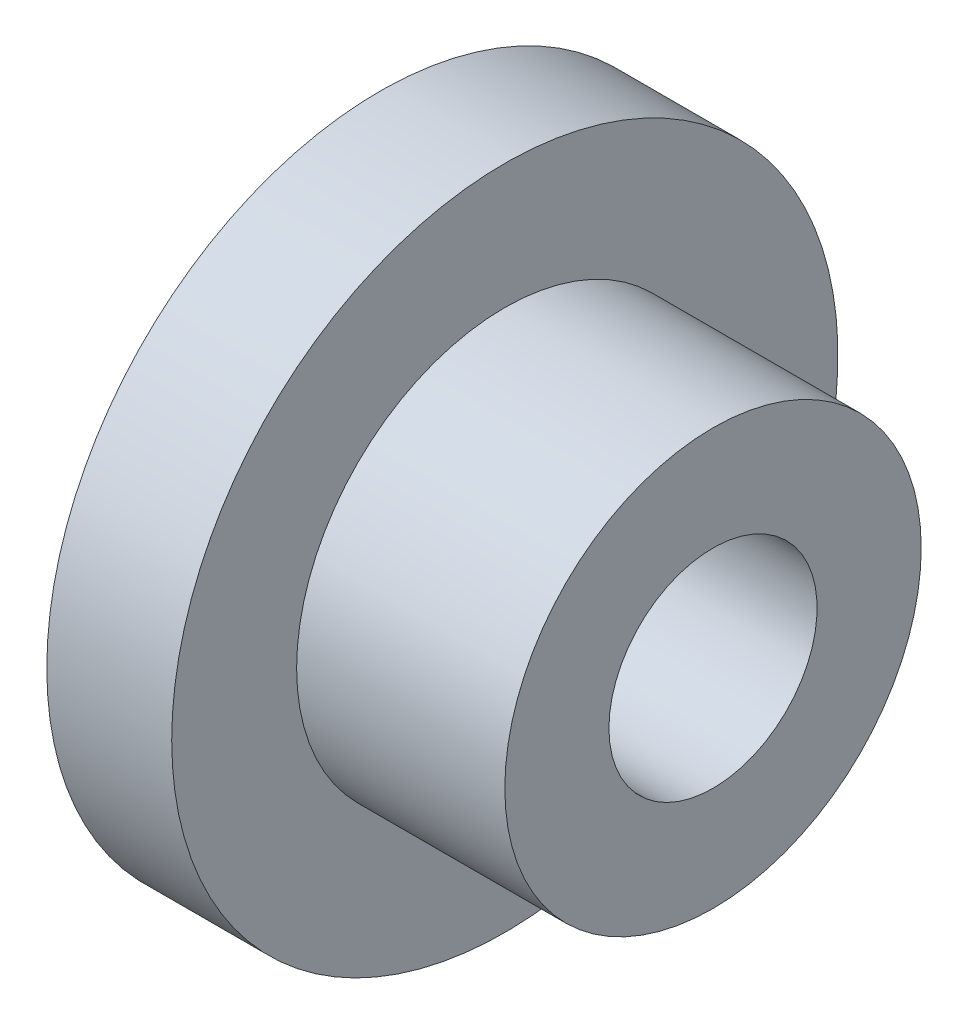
from build123d import *


with BuildPart() as part:
    # Sketch1 → Revolve1 (revolve)
    with BuildSketch(Plane.XY, mode=Mode.PRIVATE) as revolve1_sk:
        Polygon((0, 8), (0, 2.5), (8, 2.5), (8, 5), (3, 5), (3, 8), align=None)
    revolve(revolve1_sk.sketch.rotate(Axis((0, 0, 0), (1, 0, 0)), 90), axis=Axis((0, 0, 0), (1, 0, 0)))


solid = part.part
